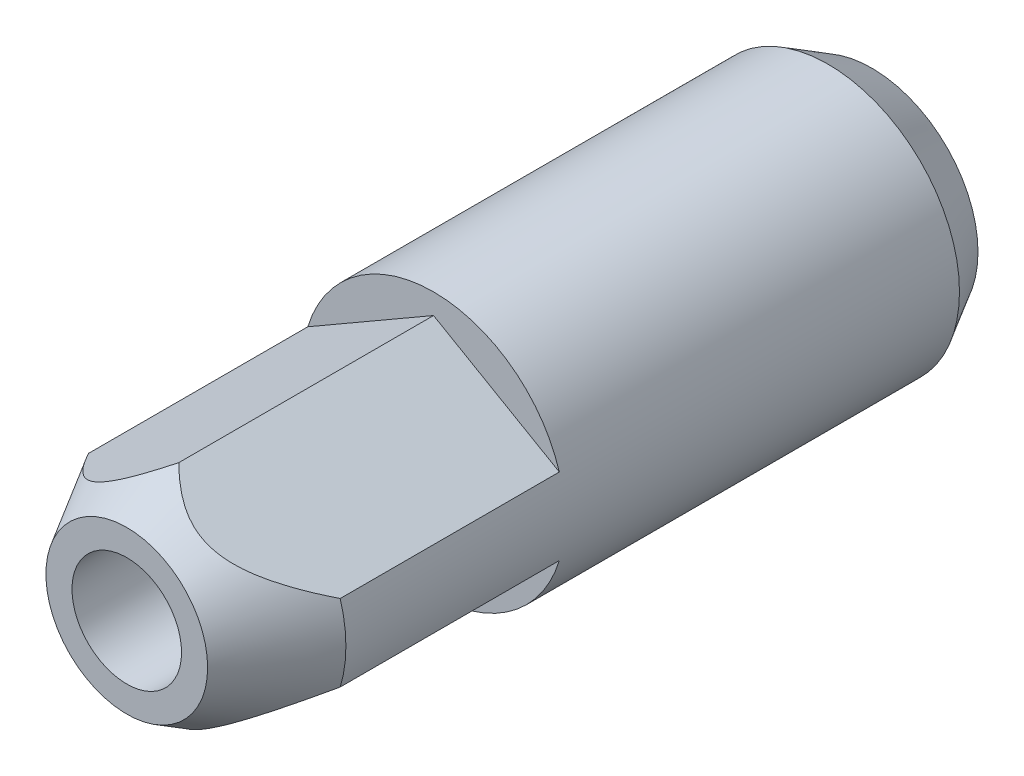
ISO-10303-21;
HEADER;
FILE_DESCRIPTION(('STEP AP214'),'2;1');
FILE_NAME('part.step','',(''),(''),'','','');
FILE_SCHEMA(('AUTOMOTIVE_DESIGN { 1 0 10303 214 1 1 1 1 }'));
ENDSEC;
DATA;
#1=APPLICATION_CONTEXT('core data for automotive mechanical design processes');
#2=APPLICATION_PROTOCOL_DEFINITION('international standard','automotive_design',2000,#1);
#3=PRODUCT_CONTEXT('',#1,'mechanical');
#4=PRODUCT('Part','Part','',(#3));
#5=PRODUCT_RELATED_PRODUCT_CATEGORY('part','',(#4));
#6=PRODUCT_DEFINITION_FORMATION('','',#4);
#7=PRODUCT_DEFINITION_CONTEXT('part definition',#1,'design');
#8=PRODUCT_DEFINITION('design','',#6,#7);
#9=PRODUCT_DEFINITION_SHAPE('','',#8);
#10=(LENGTH_UNIT() NAMED_UNIT(*) SI_UNIT(.MILLI.,.METRE.));
#11=(NAMED_UNIT(*) PLANE_ANGLE_UNIT() SI_UNIT($,.RADIAN.));
#12=(NAMED_UNIT(*) SI_UNIT($,.STERADIAN.) SOLID_ANGLE_UNIT());
#13=UNCERTAINTY_MEASURE_WITH_UNIT(LENGTH_MEASURE(1.E-05),#10,'distance_accuracy_value','');
#14=(GEOMETRIC_REPRESENTATION_CONTEXT(3) GLOBAL_UNCERTAINTY_ASSIGNED_CONTEXT((#13)) GLOBAL_UNIT_ASSIGNED_CONTEXT((#10,
#11,#12)) REPRESENTATION_CONTEXT('',''));
#15=CARTESIAN_POINT('',(0.,0.,0.));
#16=DIRECTION('',(0.,0.,1.));
#17=DIRECTION('',(1.,0.,0.));
#18=AXIS2_PLACEMENT_3D('',#15,#16,#17);
#19=CARTESIAN_POINT('',(0.,0.,30.));
#20=DIRECTION('',(0.,0.,-1.));
#21=DIRECTION('',(-1.,0.,0.));
#22=AXIS2_PLACEMENT_3D('',#19,#20,#21);
#23=CONICAL_SURFACE('',#22,6.,0.523598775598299);
#24=CARTESIAN_POINT('',(0.,0.,34.));
#25=DIRECTION('',(0.,0.,1.));
#26=DIRECTION('',(1.,0.,0.));
#27=AXIS2_PLACEMENT_3D('',#24,#25,#26);
#28=CIRCLE('',#27,3.69059892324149);
#29=CARTESIAN_POINT('',(3.69059892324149,0.,34.));
#30=VERTEX_POINT('',#29);
#31=EDGE_CURVE('E23',#30,#30,#28,.T.);
#32=ORIENTED_EDGE('',*,*,#31,.F.);
#33=EDGE_LOOP('',(#32));
#34=FACE_BOUND('',#33,.T.);
#35=CARTESIAN_POINT('',(-0.000199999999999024,5.06359802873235,31.6218957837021));
#36=CARTESIAN_POINT('',(0.0456557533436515,5.0371231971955,31.6677499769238));
#37=CARTESIAN_POINT('',(0.0919689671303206,5.01038425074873,31.7129927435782));
#38=CARTESIAN_POINT('',(0.185610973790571,4.95632001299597,31.802085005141));
#39=CARTESIAN_POINT('',(0.232940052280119,4.92899455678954,31.8459340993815));
#40=CARTESIAN_POINT('',(0.377050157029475,4.84579254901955,31.9755348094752));
#41=CARTESIAN_POINT('',(0.475488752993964,4.78895899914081,32.0588689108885));
#42=CARTESIAN_POINT('',(0.680067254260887,4.67084554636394,32.2190872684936));
#43=CARTESIAN_POINT('',(0.786341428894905,4.60948812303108,32.295745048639));
#44=CARTESIAN_POINT('',(1.00464804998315,4.48344873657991,32.436841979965));
#45=CARTESIAN_POINT('',(1.11666704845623,4.41877453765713,32.5013081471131));
#46=CARTESIAN_POINT('',(1.29419931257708,4.31627623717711,32.5884036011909));
#47=CARTESIAN_POINT('',(1.35763349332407,4.27965249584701,32.6167078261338));
#48=CARTESIAN_POINT('',(1.48616325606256,4.20544580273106,32.6678302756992));
#49=CARTESIAN_POINT('',(1.55125896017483,4.16786278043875,32.6906480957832));
#50=CARTESIAN_POINT('',(1.68233479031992,4.09218611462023,32.7299254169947));
#51=CARTESIAN_POINT('',(1.74830382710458,4.05409887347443,32.7464338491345));
#52=CARTESIAN_POINT('',(1.8812347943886,3.97735114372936,32.7727502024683));
#53=CARTESIAN_POINT('',(1.94819653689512,3.93869076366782,32.7825593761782));
#54=CARTESIAN_POINT('',(2.08326503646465,3.86070892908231,32.7951455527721));
#55=CARTESIAN_POINT('',(2.15137661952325,3.8213846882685,32.7978544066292));
#56=CARTESIAN_POINT('',(2.28751896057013,3.74278287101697,32.7959266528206));
#57=CARTESIAN_POINT('',(2.35554971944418,3.70350529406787,32.79129012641));
#58=CARTESIAN_POINT('',(2.49105945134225,3.6252687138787,32.7748555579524));
#59=CARTESIAN_POINT('',(2.5585374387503,3.58631027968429,32.7630467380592));
#60=CARTESIAN_POINT('',(2.69237138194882,3.50904121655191,32.7327379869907));
#61=CARTESIAN_POINT('',(2.75872663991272,3.47073099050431,32.7142340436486));
#62=CARTESIAN_POINT('',(2.992983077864,3.33548297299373,32.6373211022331));
#63=CARTESIAN_POINT('',(3.15681232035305,3.24089611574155,32.5618613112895));
#64=CARTESIAN_POINT('',(3.39384465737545,3.10404543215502,32.4276131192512));
#65=CARTESIAN_POINT('',(3.47178448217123,3.05904685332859,32.3790464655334));
#66=CARTESIAN_POINT('',(3.62477355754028,2.97071856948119,32.2761608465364));
#67=CARTESIAN_POINT('',(3.69982356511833,2.92738842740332,32.2218434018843));
#68=CARTESIAN_POINT('',(3.87054592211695,2.82882182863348,32.0906244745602));
#69=CARTESIAN_POINT('',(3.96522544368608,2.7741585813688,32.0120170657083));
#70=CARTESIAN_POINT('',(4.15052824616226,2.66717395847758,31.8486252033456));
#71=CARTESIAN_POINT('',(4.24114964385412,2.61485367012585,31.7638379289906));
#72=CARTESIAN_POINT('',(4.41912601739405,2.51209896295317,31.5892470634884));
#73=CARTESIAN_POINT('',(4.50647069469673,2.46167049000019,31.4994295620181));
#74=CARTESIAN_POINT('',(4.67813923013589,2.362557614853,31.3160201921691));
#75=CARTESIAN_POINT('',(4.76246273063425,2.31387341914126,31.2224278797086));
#76=CARTESIAN_POINT('',(4.92413183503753,2.22053371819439,31.0372571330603));
#77=CARTESIAN_POINT('',(5.00161079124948,2.17580122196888,30.9458332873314));
#78=CARTESIAN_POINT('',(5.15456019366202,2.08749584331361,30.7607646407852));
#79=CARTESIAN_POINT('',(5.23003049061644,2.04392304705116,30.6671196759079));
#80=CARTESIAN_POINT('',(5.37866741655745,1.9581074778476,30.4786978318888));
#81=CARTESIAN_POINT('',(5.4518469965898,1.91585722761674,30.3839345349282));
#82=CARTESIAN_POINT('',(5.59667485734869,1.83224082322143,30.1928988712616));
#83=CARTESIAN_POINT('',(5.66832349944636,1.79087446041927,30.0966268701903));
#84=CARTESIAN_POINT('',(5.7393201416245,1.74988452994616,29.9997269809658));
#85=B_SPLINE_CURVE_WITH_KNOTS('',3,(#35,#36,#37,#38,#39,#40,#41,#42,#43,#44,#45,#46,#47,#48,#49,
#50,#51,#52,#53,#54,#55,#56,#57,#58,#59,#60,#61,#62,#63,#64,#65,#66,#67,#68,#69,#70,#71,#72,#73,
#74,#75,#76,#77,#78,#79,#80,#81,#82,#83,#84),.UNSPECIFIED.,.F.,.F.,(4,2,2,2,2,2,2,2,2,2,2,2,2,2,
2,2,2,2,2,2,2,2,2,2,4),(0.,0.210124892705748,0.420309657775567,0.842819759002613,
1.27641080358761,1.70902947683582,1.94442910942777,2.17984609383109,2.41339840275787,
2.64690703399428,2.88264881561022,3.11838798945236,3.35448228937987,3.59071830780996,
4.19771203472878,4.504405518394,4.81101810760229,5.21469491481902,5.61855715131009,
6.02359738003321,6.42868539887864,6.81238472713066,7.1961124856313,7.57698878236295,
7.95777415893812),.UNSPECIFIED.);
#86=CARTESIAN_POINT('',(0.,5.06348255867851,31.6220957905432));
#87=VERTEX_POINT('',#86);
#88=CARTESIAN_POINT('',(5.7391201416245,1.75,30.));
#89=VERTEX_POINT('',#88);
#90=EDGE_CURVE('E102',#87,#89,#85,.T.);
#91=ORIENTED_EDGE('',*,*,#90,.F.);
#92=CARTESIAN_POINT('',(0.000199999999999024,5.06359802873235,31.6218957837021));
#93=CARTESIAN_POINT('',(-0.0456557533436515,5.0371231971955,31.6677499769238));
#94=CARTESIAN_POINT('',(-0.0919689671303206,5.01038425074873,31.7129927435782));
#95=CARTESIAN_POINT('',(-0.185610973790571,4.95632001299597,31.802085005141));
#96=CARTESIAN_POINT('',(-0.232940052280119,4.92899455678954,31.8459340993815));
#97=CARTESIAN_POINT('',(-0.377050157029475,4.84579254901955,31.9755348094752));
#98=CARTESIAN_POINT('',(-0.475488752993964,4.78895899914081,32.0588689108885));
#99=CARTESIAN_POINT('',(-0.680067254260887,4.67084554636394,32.2190872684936));
#100=CARTESIAN_POINT('',(-0.786341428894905,4.60948812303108,32.295745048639));
#101=CARTESIAN_POINT('',(-1.00464804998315,4.48344873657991,32.436841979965));
#102=CARTESIAN_POINT('',(-1.11666704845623,4.41877453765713,32.5013081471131));
#103=CARTESIAN_POINT('',(-1.29419931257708,4.31627623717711,32.5884036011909));
#104=CARTESIAN_POINT('',(-1.35763349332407,4.27965249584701,32.6167078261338));
#105=CARTESIAN_POINT('',(-1.48616325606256,4.20544580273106,32.6678302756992));
#106=CARTESIAN_POINT('',(-1.55125896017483,4.16786278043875,32.6906480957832));
#107=CARTESIAN_POINT('',(-1.68233479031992,4.09218611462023,32.7299254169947));
#108=CARTESIAN_POINT('',(-1.74830382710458,4.05409887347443,32.7464338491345));
#109=CARTESIAN_POINT('',(-1.8812347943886,3.97735114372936,32.7727502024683));
#110=CARTESIAN_POINT('',(-1.94819653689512,3.93869076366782,32.7825593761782));
#111=CARTESIAN_POINT('',(-2.08326503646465,3.86070892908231,32.7951455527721));
#112=CARTESIAN_POINT('',(-2.15137661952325,3.8213846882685,32.7978544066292));
#113=CARTESIAN_POINT('',(-2.28751896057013,3.74278287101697,32.7959266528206));
#114=CARTESIAN_POINT('',(-2.35554971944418,3.70350529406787,32.79129012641));
#115=CARTESIAN_POINT('',(-2.49105945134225,3.6252687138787,32.7748555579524));
#116=CARTESIAN_POINT('',(-2.5585374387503,3.58631027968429,32.7630467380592));
#117=CARTESIAN_POINT('',(-2.69237138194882,3.50904121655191,32.7327379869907));
#118=CARTESIAN_POINT('',(-2.75872663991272,3.47073099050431,32.7142340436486));
#119=CARTESIAN_POINT('',(-2.992983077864,3.33548297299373,32.6373211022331));
#120=CARTESIAN_POINT('',(-3.15681232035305,3.24089611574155,32.5618613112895));
#121=CARTESIAN_POINT('',(-3.39384465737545,3.10404543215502,32.4276131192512));
#122=CARTESIAN_POINT('',(-3.47178448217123,3.05904685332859,32.3790464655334));
#123=CARTESIAN_POINT('',(-3.62477355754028,2.97071856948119,32.2761608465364));
#124=CARTESIAN_POINT('',(-3.69982356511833,2.92738842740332,32.2218434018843));
#125=CARTESIAN_POINT('',(-3.87054592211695,2.82882182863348,32.0906244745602));
#126=CARTESIAN_POINT('',(-3.96522544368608,2.7741585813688,32.0120170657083));
#127=CARTESIAN_POINT('',(-4.15052824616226,2.66717395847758,31.8486252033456));
#128=CARTESIAN_POINT('',(-4.24114964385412,2.61485367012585,31.7638379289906));
#129=CARTESIAN_POINT('',(-4.41912601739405,2.51209896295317,31.5892470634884));
#130=CARTESIAN_POINT('',(-4.50647069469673,2.46167049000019,31.4994295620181));
#131=CARTESIAN_POINT('',(-4.67813923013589,2.362557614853,31.3160201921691));
#132=CARTESIAN_POINT('',(-4.76246273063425,2.31387341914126,31.2224278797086));
#133=CARTESIAN_POINT('',(-4.92413183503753,2.22053371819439,31.0372571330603));
#134=CARTESIAN_POINT('',(-5.00161079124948,2.17580122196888,30.9458332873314));
#135=CARTESIAN_POINT('',(-5.15456019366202,2.08749584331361,30.7607646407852));
#136=CARTESIAN_POINT('',(-5.23003049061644,2.04392304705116,30.6671196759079));
#137=CARTESIAN_POINT('',(-5.37866741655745,1.9581074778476,30.4786978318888));
#138=CARTESIAN_POINT('',(-5.4518469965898,1.91585722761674,30.3839345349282));
#139=CARTESIAN_POINT('',(-5.59667485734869,1.83224082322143,30.1928988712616));
#140=CARTESIAN_POINT('',(-5.66832349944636,1.79087446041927,30.0966268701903));
#141=CARTESIAN_POINT('',(-5.7393201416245,1.74988452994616,29.9997269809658));
#142=B_SPLINE_CURVE_WITH_KNOTS('',3,(#92,#93,#94,#95,#96,#97,#98,#99,#100,#101,#102,#103,#104,
#105,#106,#107,#108,#109,#110,#111,#112,#113,#114,#115,#116,#117,#118,#119,#120,#121,#122,#123,
#124,#125,#126,#127,#128,#129,#130,#131,#132,#133,#134,#135,#136,#137,#138,#139,#140,#141),
.UNSPECIFIED.,.F.,.F.,(4,2,2,2,2,2,2,2,2,2,2,2,2,2,2,2,2,2,2,2,2,2,2,2,4),(0.,0.210124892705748,
0.420309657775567,0.842819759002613,1.27641080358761,1.70902947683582,1.94442910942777,
2.17984609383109,2.41339840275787,2.64690703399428,2.88264881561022,3.11838798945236,
3.35448228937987,3.59071830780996,4.19771203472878,4.504405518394,4.81101810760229,
5.21469491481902,5.61855715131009,6.02359738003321,6.42868539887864,6.81238472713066,
7.1961124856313,7.57698878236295,7.95777415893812),.UNSPECIFIED.);
#143=CARTESIAN_POINT('',(-5.7391201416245,1.75,30.));
#144=VERTEX_POINT('',#143);
#145=EDGE_CURVE('E75',#87,#144,#142,.T.);
#146=ORIENTED_EDGE('',*,*,#145,.T.);
#147=CARTESIAN_POINT('',(0.,0.,30.));
#148=DIRECTION('',(0.,0.,1.));
#149=DIRECTION('',(1.,0.,0.));
#150=AXIS2_PLACEMENT_3D('',#147,#148,#149);
#151=CIRCLE('',#150,6.);
#152=CARTESIAN_POINT('',(-5.7391201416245,-1.75,30.));
#153=VERTEX_POINT('',#152);
#154=EDGE_CURVE('E155',#144,#153,#151,.T.);
#155=ORIENTED_EDGE('',*,*,#154,.T.);
#156=CARTESIAN_POINT('',(0.000199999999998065,-5.0635980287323,31.6218957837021));
#157=CARTESIAN_POINT('',(-0.0456557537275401,-5.03712319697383,31.6677499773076));
#158=CARTESIAN_POINT('',(-0.0919689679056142,-5.0103842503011,31.7129927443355));
#159=CARTESIAN_POINT('',(-0.18561097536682,-4.95632001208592,31.8020850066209));
#160=CARTESIAN_POINT('',(-0.232940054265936,-4.92899455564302,31.8459341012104));
#161=CARTESIAN_POINT('',(-0.377050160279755,-4.84579254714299,31.9755348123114));
#162=CARTESIAN_POINT('',(-0.475488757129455,-4.78895899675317,32.0588689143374));
#163=CARTESIAN_POINT('',(-0.680067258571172,-4.67084554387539,32.2190872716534));
#164=CARTESIAN_POINT('',(-0.786341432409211,-4.6094881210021,32.2957450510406));
#165=CARTESIAN_POINT('',(-1.00464805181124,-4.48344873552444,32.436841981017));
#166=CARTESIAN_POINT('',(-1.11666704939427,-4.4187745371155,32.5013081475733));
#167=CARTESIAN_POINT('',(-1.29419931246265,-4.31627623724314,32.5884036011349));
#168=CARTESIAN_POINT('',(-1.35763349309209,-4.27965249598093,32.6167078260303));
#169=CARTESIAN_POINT('',(-1.48616325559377,-4.20544580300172,32.667830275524));
#170=CARTESIAN_POINT('',(-1.55125895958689,-4.16786278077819,32.6906480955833));
#171=CARTESIAN_POINT('',(-1.68233478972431,-4.0921861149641,32.7299254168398));
#172=CARTESIAN_POINT('',(-1.74830382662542,-4.05409887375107,32.7464338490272));
#173=CARTESIAN_POINT('',(-1.88123479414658,-3.97735114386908,32.7727502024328));
#174=CARTESIAN_POINT('',(-1.94819653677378,-3.93869076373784,32.7825593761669));
#175=CARTESIAN_POINT('',(-2.08326503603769,-3.86070892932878,32.7951455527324));
#176=CARTESIAN_POINT('',(-2.15137661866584,-3.82138468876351,32.7978544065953));
#177=CARTESIAN_POINT('',(-2.28751895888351,-3.74278287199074,32.7959266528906));
#178=CARTESIAN_POINT('',(-2.35554971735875,-3.70350529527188,32.7912901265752));
#179=CARTESIAN_POINT('',(-2.49105944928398,-3.62526871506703,32.7748555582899));
#180=CARTESIAN_POINT('',(-2.5585374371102,-3.5863102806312,32.7630467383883));
#181=CARTESIAN_POINT('',(-2.69237138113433,-3.50904121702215,32.7327379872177));
#182=CARTESIAN_POINT('',(-2.75872663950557,-3.47073099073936,32.7142340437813));
#183=CARTESIAN_POINT('',(-2.99298308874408,-3.33548296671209,32.6373210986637));
#184=CARTESIAN_POINT('',(-3.15681234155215,-3.24089610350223,32.561861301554));
#185=CARTESIAN_POINT('',(-3.39384468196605,-3.10404541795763,32.4276131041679));
#186=CARTESIAN_POINT('',(-3.47178450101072,-3.0590468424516,32.3790464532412));
#187=CARTESIAN_POINT('',(-3.62477356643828,-2.97071856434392,32.2761608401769));
#188=CARTESIAN_POINT('',(-3.69982356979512,-2.92738842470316,32.2218433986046));
#189=CARTESIAN_POINT('',(-3.87054287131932,-2.82882359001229,32.0906268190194));
#190=CARTESIAN_POINT('',(-3.96521948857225,-2.77416201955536,32.0120220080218));
#191=CARTESIAN_POINT('',(-4.15051671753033,-2.66718061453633,31.8486356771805));
#192=CARTESIAN_POINT('',(-4.24113544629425,-2.61486186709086,31.7638513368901));
#193=CARTESIAN_POINT('',(-4.41910664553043,-2.51211014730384,31.5892665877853));
#194=CARTESIAN_POINT('',(-4.50644881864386,-2.4616831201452,31.4994522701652));
#195=CARTESIAN_POINT('',(-4.67811249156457,-2.36257305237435,31.3160494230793));
#196=CARTESIAN_POINT('',(-4.76243363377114,-2.31389021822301,31.2224604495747));
#197=CARTESIAN_POINT('',(-4.92409843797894,-2.22055299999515,31.0372961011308));
#198=CARTESIAN_POINT('',(-5.00157544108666,-2.1758216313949,30.9458753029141));
#199=CARTESIAN_POINT('',(-5.15452100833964,-2.08751846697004,30.7608128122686));
#200=CARTESIAN_POINT('',(-5.22998942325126,-2.0439467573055,30.6671709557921));
#201=CARTESIAN_POINT('',(-5.37862268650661,-1.95813330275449,30.4787553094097));
#202=CARTESIAN_POINT('',(-5.45180048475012,-1.9158840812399,30.383995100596));
#203=CARTESIAN_POINT('',(-5.59662482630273,-1.83226970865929,30.1929656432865));
#204=CARTESIAN_POINT('',(-5.66827173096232,-1.79090434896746,30.0966967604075));
#205=CARTESIAN_POINT('',(-5.73926665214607,-1.74991541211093,29.9998));
#206=B_SPLINE_CURVE_WITH_KNOTS('',3,(#156,#157,#158,#159,#160,#161,#162,#163,#164,#165,#166,
#167,#168,#169,#170,#171,#172,#173,#174,#175,#176,#177,#178,#179,#180,#181,#182,#183,#184,#185,
#186,#187,#188,#189,#190,#191,#192,#193,#194,#195,#196,#197,#198,#199,#200,#201,#202,#203,#204,
#205),.UNSPECIFIED.,.F.,.F.,(4,2,2,2,2,2,2,2,2,2,2,2,2,2,2,2,2,2,2,2,2,2,2,2,4),(0.,
0.210124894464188,0.420309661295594,0.84281976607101,1.27641080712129,1.7090294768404,
1.94442910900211,2.17984609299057,2.41339840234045,2.6469070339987,2.88264881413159,
3.11838798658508,3.35448228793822,3.59071830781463,4.19771207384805,4.50440553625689,
4.81101810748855,5.21468222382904,5.61853174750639,6.02355915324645,6.42863434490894,
6.81232240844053,7.19603890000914,7.57690417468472,7.9576785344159),.UNSPECIFIED.);
#207=CARTESIAN_POINT('',(0.,-5.06348255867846,31.6220957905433));
#208=VERTEX_POINT('',#207);
#209=EDGE_CURVE('E129',#208,#153,#206,.T.);
#210=ORIENTED_EDGE('',*,*,#209,.F.);
#211=CARTESIAN_POINT('',(-0.000200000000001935,-5.0635980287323,31.6218957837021));
#212=CARTESIAN_POINT('',(0.0456557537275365,-5.03712319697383,31.6677499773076));
#213=CARTESIAN_POINT('',(0.0919689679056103,-5.0103842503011,31.7129927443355));
#214=CARTESIAN_POINT('',(0.185610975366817,-4.95632001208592,31.8020850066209));
#215=CARTESIAN_POINT('',(0.232940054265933,-4.92899455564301,31.8459341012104));
#216=CARTESIAN_POINT('',(0.377050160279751,-4.84579254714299,31.9755348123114));
#217=CARTESIAN_POINT('',(0.475488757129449,-4.78895899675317,32.0588689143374));
#218=CARTESIAN_POINT('',(0.680067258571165,-4.67084554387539,32.2190872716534));
#219=CARTESIAN_POINT('',(0.786341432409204,-4.6094881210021,32.2957450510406));
#220=CARTESIAN_POINT('',(1.00464805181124,-4.48344873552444,32.436841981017));
#221=CARTESIAN_POINT('',(1.11666704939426,-4.4187745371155,32.5013081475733));
#222=CARTESIAN_POINT('',(1.29419931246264,-4.31627623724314,32.5884036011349));
#223=CARTESIAN_POINT('',(1.35763349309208,-4.27965249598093,32.6167078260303));
#224=CARTESIAN_POINT('',(1.48616325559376,-4.20544580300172,32.667830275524));
#225=CARTESIAN_POINT('',(1.55125895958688,-4.16786278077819,32.6906480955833));
#226=CARTESIAN_POINT('',(1.6823347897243,-4.0921861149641,32.7299254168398));
#227=CARTESIAN_POINT('',(1.74830382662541,-4.05409887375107,32.7464338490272));
#228=CARTESIAN_POINT('',(1.88123479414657,-3.97735114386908,32.7727502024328));
#229=CARTESIAN_POINT('',(1.94819653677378,-3.93869076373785,32.7825593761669));
#230=CARTESIAN_POINT('',(2.08326503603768,-3.86070892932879,32.7951455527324));
#231=CARTESIAN_POINT('',(2.15137661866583,-3.82138468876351,32.7978544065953));
#232=CARTESIAN_POINT('',(2.28751895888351,-3.74278287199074,32.7959266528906));
#233=CARTESIAN_POINT('',(2.35554971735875,-3.70350529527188,32.7912901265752));
#234=CARTESIAN_POINT('',(2.49105944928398,-3.62526871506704,32.7748555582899));
#235=CARTESIAN_POINT('',(2.55853743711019,-3.5863102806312,32.7630467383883));
#236=CARTESIAN_POINT('',(2.69237138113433,-3.50904121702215,32.7327379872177));
#237=CARTESIAN_POINT('',(2.75872663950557,-3.47073099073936,32.7142340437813));
#238=CARTESIAN_POINT('',(2.99298308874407,-3.33548296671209,32.6373210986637));
#239=CARTESIAN_POINT('',(3.15681234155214,-3.24089610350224,32.5618613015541));
#240=CARTESIAN_POINT('',(3.39384468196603,-3.10404541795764,32.4276131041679));
#241=CARTESIAN_POINT('',(3.47178450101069,-3.05904684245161,32.3790464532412));
#242=CARTESIAN_POINT('',(3.62477356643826,-2.97071856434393,32.276160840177));
#243=CARTESIAN_POINT('',(3.69982356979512,-2.92738842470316,32.2218433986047));
#244=CARTESIAN_POINT('',(3.87054287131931,-2.8288235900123,32.0906268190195));
#245=CARTESIAN_POINT('',(3.96521948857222,-2.77416201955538,32.0120220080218));
#246=CARTESIAN_POINT('',(4.1505167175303,-2.66718061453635,31.8486356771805));
#247=CARTESIAN_POINT('',(4.24113544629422,-2.61486186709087,31.7638513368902));
#248=CARTESIAN_POINT('',(4.41910664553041,-2.51211014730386,31.5892665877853));
#249=CARTESIAN_POINT('',(4.50644881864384,-2.46168312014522,31.4994522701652));
#250=CARTESIAN_POINT('',(4.67811249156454,-2.36257305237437,31.3160494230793));
#251=CARTESIAN_POINT('',(4.76243363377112,-2.31389021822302,31.2224604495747));
#252=CARTESIAN_POINT('',(4.92409843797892,-2.22055299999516,31.0372961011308));
#253=CARTESIAN_POINT('',(5.00157544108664,-2.17582163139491,30.9458753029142));
#254=CARTESIAN_POINT('',(5.15452100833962,-2.08751846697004,30.7608128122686));
#255=CARTESIAN_POINT('',(5.22998942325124,-2.04394675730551,30.6671709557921));
#256=CARTESIAN_POINT('',(5.3786226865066,-1.95813330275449,30.4787553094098));
#257=CARTESIAN_POINT('',(5.45180048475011,-1.9158840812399,30.383995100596));
#258=CARTESIAN_POINT('',(5.59662482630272,-1.83226970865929,30.1929656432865));
#259=CARTESIAN_POINT('',(5.66827173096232,-1.79090434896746,30.0966967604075));
#260=CARTESIAN_POINT('',(5.73926665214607,-1.74991541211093,29.9998));
#261=B_SPLINE_CURVE_WITH_KNOTS('',3,(#211,#212,#213,#214,#215,#216,#217,#218,#219,#220,#221,
#222,#223,#224,#225,#226,#227,#228,#229,#230,#231,#232,#233,#234,#235,#236,#237,#238,#239,#240,
#241,#242,#243,#244,#245,#246,#247,#248,#249,#250,#251,#252,#253,#254,#255,#256,#257,#258,#259,
#260),.UNSPECIFIED.,.F.,.F.,(4,2,2,2,2,2,2,2,2,2,2,2,2,2,2,2,2,2,2,2,2,2,2,2,4),(0.,
0.210124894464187,0.420309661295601,0.842819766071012,1.27641080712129,1.7090294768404,
1.9444291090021,2.17984609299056,2.41339840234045,2.64690703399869,2.88264881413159,
3.11838798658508,3.35448228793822,3.59071830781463,4.19771207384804,4.50440553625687,
4.81101810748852,5.214682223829,5.61853174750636,6.02355915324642,6.42863434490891,
6.81232240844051,7.19603890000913,7.57690417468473,7.95767853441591),.UNSPECIFIED.);
#262=CARTESIAN_POINT('',(5.7391201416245,-1.75,30.));
#263=VERTEX_POINT('',#262);
#264=EDGE_CURVE('E138',#208,#263,#261,.T.);
#265=ORIENTED_EDGE('',*,*,#264,.T.);
#266=EDGE_CURVE('E156',#263,#89,#151,.T.);
#267=ORIENTED_EDGE('',*,*,#266,.T.);
#268=EDGE_LOOP('',(#91,#146,#155,#210,#265,#267));
#269=FACE_BOUND('',#268,.T.);
#270=ADVANCED_FACE('F15',(#34,#269),#23,.T.);
#271=CARTESIAN_POINT('',(0.,0.,30.));
#272=DIRECTION('',(0.,0.,1.));
#273=DIRECTION('',(1.,0.,0.));
#274=AXIS2_PLACEMENT_3D('',#271,#272,#273);
#275=CYLINDRICAL_SURFACE('',#274,6.);
#276=CARTESIAN_POINT('',(0.,0.,2.));
#277=DIRECTION('',(0.,0.,1.));
#278=DIRECTION('',(1.,0.,0.));
#279=AXIS2_PLACEMENT_3D('',#276,#277,#278);
#280=CIRCLE('',#279,6.);
#281=CARTESIAN_POINT('',(6.,0.,2.));
#282=VERTEX_POINT('',#281);
#283=EDGE_CURVE('E152',#282,#282,#280,.T.);
#284=ORIENTED_EDGE('',*,*,#283,.T.);
#285=EDGE_LOOP('',(#284));
#286=FACE_BOUND('',#285,.T.);
#287=DIRECTION('',(0.,0.,1.));
#288=VECTOR('',#287,1.);
#289=CARTESIAN_POINT('',(5.7391201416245,1.75,20.));
#290=LINE('',#289,#288);
#291=CARTESIAN_POINT('',(5.7391201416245,1.75,20.));
#292=VERTEX_POINT('',#291);
#293=EDGE_CURVE('E82',#292,#89,#290,.T.);
#294=ORIENTED_EDGE('',*,*,#293,.T.);
#295=ORIENTED_EDGE('',*,*,#266,.F.);
#296=DIRECTION('',(0.,0.,1.));
#297=VECTOR('',#296,1.);
#298=CARTESIAN_POINT('',(5.7391201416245,-1.75,20.));
#299=LINE('',#298,#297);
#300=CARTESIAN_POINT('',(5.7391201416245,-1.75,20.));
#301=VERTEX_POINT('',#300);
#302=EDGE_CURVE('E179',#301,#263,#299,.T.);
#303=ORIENTED_EDGE('',*,*,#302,.F.);
#304=CARTESIAN_POINT('',(0.,0.,20.));
#305=DIRECTION('',(0.,0.,1.));
#306=DIRECTION('',(1.,0.,0.));
#307=AXIS2_PLACEMENT_3D('',#304,#305,#306);
#308=CIRCLE('',#307,6.);
#309=CARTESIAN_POINT('',(-5.7391201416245,-1.75,20.));
#310=VERTEX_POINT('',#309);
#311=EDGE_CURVE('E169',#310,#301,#308,.T.);
#312=ORIENTED_EDGE('',*,*,#311,.F.);
#313=DIRECTION('',(0.,0.,1.));
#314=VECTOR('',#313,1.);
#315=CARTESIAN_POINT('',(-5.7391201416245,-1.75,20.));
#316=LINE('',#315,#314);
#317=EDGE_CURVE('E176',#310,#153,#316,.T.);
#318=ORIENTED_EDGE('',*,*,#317,.T.);
#319=ORIENTED_EDGE('',*,*,#154,.F.);
#320=DIRECTION('',(0.,0.,1.));
#321=VECTOR('',#320,1.);
#322=CARTESIAN_POINT('',(-5.7391201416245,1.75,20.));
#323=LINE('',#322,#321);
#324=CARTESIAN_POINT('',(-5.7391201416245,1.75,20.));
#325=VERTEX_POINT('',#324);
#326=EDGE_CURVE('E78',#325,#144,#323,.T.);
#327=ORIENTED_EDGE('',*,*,#326,.F.);
#328=CARTESIAN_POINT('',(0.,0.,20.));
#329=DIRECTION('',(0.,0.,1.));
#330=DIRECTION('',(1.,0.,0.));
#331=AXIS2_PLACEMENT_3D('',#328,#329,#330);
#332=CIRCLE('',#331,6.);
#333=EDGE_CURVE('E86',#292,#325,#332,.T.);
#334=ORIENTED_EDGE('',*,*,#333,.F.);
#335=EDGE_LOOP('',(#294,#295,#303,#312,#318,#319,#327,#334));
#336=FACE_BOUND('',#335,.T.);
#337=ADVANCED_FACE('F165',(#286,#336),#275,.T.);
#338=CARTESIAN_POINT('',(0.,0.,30.));
#339=DIRECTION('',(0.,0.,1.));
#340=DIRECTION('',(1.,0.,0.));
#341=AXIS2_PLACEMENT_3D('',#338,#339,#340);
#342=CYLINDRICAL_SURFACE('',#341,2.5);
#343=CARTESIAN_POINT('',(0.,0.,24.));
#344=DIRECTION('',(0.,0.,1.));
#345=DIRECTION('',(1.,0.,0.));
#346=AXIS2_PLACEMENT_3D('',#343,#344,#345);
#347=CIRCLE('',#346,2.5);
#348=CARTESIAN_POINT('',(2.5,0.,24.));
#349=VERTEX_POINT('',#348);
#350=EDGE_CURVE('E89',#349,#349,#347,.T.);
#351=ORIENTED_EDGE('',*,*,#350,.F.);
#352=EDGE_LOOP('',(#351));
#353=FACE_BOUND('',#352,.T.);
#354=CARTESIAN_POINT('',(0.,0.,34.));
#355=DIRECTION('',(0.,0.,1.));
#356=DIRECTION('',(1.,0.,0.));
#357=AXIS2_PLACEMENT_3D('',#354,#355,#356);
#358=CIRCLE('',#357,2.5);
#359=CARTESIAN_POINT('',(2.5,0.,34.));
#360=VERTEX_POINT('',#359);
#361=EDGE_CURVE('E9',#360,#360,#358,.T.);
#362=ORIENTED_EDGE('',*,*,#361,.T.);
#363=EDGE_LOOP('',(#362));
#364=FACE_BOUND('',#363,.T.);
#365=ADVANCED_FACE('F17',(#353,#364),#342,.F.);
#366=CARTESIAN_POINT('',(3.69059892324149,0.,34.));
#367=DIRECTION('',(0.,0.,-1.));
#368=DIRECTION('',(-1.,0.,0.));
#369=AXIS2_PLACEMENT_3D('',#366,#367,#368);
#370=PLANE('',#369);
#371=ORIENTED_EDGE('',*,*,#361,.F.);
#372=EDGE_LOOP('',(#371));
#373=FACE_BOUND('',#372,.T.);
#374=ORIENTED_EDGE('',*,*,#31,.T.);
#375=EDGE_LOOP('',(#374));
#376=FACE_BOUND('',#375,.T.);
#377=ADVANCED_FACE('F161',(#373,#376),#370,.F.);
#378=CARTESIAN_POINT('',(0.,0.,0.));
#379=DIRECTION('',(0.,0.,1.));
#380=DIRECTION('',(1.,0.,0.));
#381=AXIS2_PLACEMENT_3D('',#378,#379,#380);
#382=CONICAL_SURFACE('',#381,4.84529946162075,0.523598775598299);
#383=ORIENTED_EDGE('',*,*,#283,.F.);
#384=EDGE_LOOP('',(#383));
#385=FACE_BOUND('',#384,.T.);
#386=CARTESIAN_POINT('',(0.,0.,0.));
#387=DIRECTION('',(0.,0.,1.));
#388=DIRECTION('',(1.,0.,0.));
#389=AXIS2_PLACEMENT_3D('',#386,#387,#388);
#390=CIRCLE('',#389,4.84529946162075);
#391=CARTESIAN_POINT('',(4.84529946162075,0.,0.));
#392=VERTEX_POINT('',#391);
#393=EDGE_CURVE('E149',#392,#392,#390,.T.);
#394=ORIENTED_EDGE('',*,*,#393,.T.);
#395=EDGE_LOOP('',(#394));
#396=FACE_BOUND('',#395,.T.);
#397=ADVANCED_FACE('F252',(#385,#396),#382,.T.);
#398=CARTESIAN_POINT('',(1.,0.,0.));
#399=DIRECTION('',(0.,0.,1.));
#400=DIRECTION('',(1.,0.,0.));
#401=AXIS2_PLACEMENT_3D('',#398,#399,#400);
#402=PLANE('',#401);
#403=ORIENTED_EDGE('',*,*,#393,.F.);
#404=EDGE_LOOP('',(#403));
#405=FACE_BOUND('',#404,.T.);
#406=CARTESIAN_POINT('',(0.,0.,0.));
#407=DIRECTION('',(0.,0.,1.));
#408=DIRECTION('',(1.,0.,0.));
#409=AXIS2_PLACEMENT_3D('',#406,#407,#408);
#410=CIRCLE('',#409,1.);
#411=CARTESIAN_POINT('',(1.,0.,0.));
#412=VERTEX_POINT('',#411);
#413=EDGE_CURVE('E146',#412,#412,#410,.T.);
#414=ORIENTED_EDGE('',*,*,#413,.T.);
#415=EDGE_LOOP('',(#414));
#416=FACE_BOUND('',#415,.T.);
#417=ADVANCED_FACE('F257',(#405,#416),#402,.F.);
#418=CARTESIAN_POINT('',(0.,0.,30.));
#419=DIRECTION('',(0.,0.,1.));
#420=DIRECTION('',(1.,0.,0.));
#421=AXIS2_PLACEMENT_3D('',#418,#419,#420);
#422=CYLINDRICAL_SURFACE('',#421,1.);
#423=ORIENTED_EDGE('',*,*,#413,.F.);
#424=EDGE_LOOP('',(#423));
#425=FACE_BOUND('',#424,.T.);
#426=CARTESIAN_POINT('',(0.,0.,4.));
#427=DIRECTION('',(0.,0.,1.));
#428=DIRECTION('',(1.,0.,0.));
#429=AXIS2_PLACEMENT_3D('',#426,#427,#428);
#430=CIRCLE('',#429,1.);
#431=CARTESIAN_POINT('',(1.,0.,4.));
#432=VERTEX_POINT('',#431);
#433=EDGE_CURVE('E137',#432,#432,#430,.T.);
#434=ORIENTED_EDGE('',*,*,#433,.T.);
#435=EDGE_LOOP('',(#434));
#436=FACE_BOUND('',#435,.T.);
#437=ADVANCED_FACE('F266',(#425,#436),#422,.F.);
#438=CARTESIAN_POINT('',(0.,0.,4.));
#439=DIRECTION('',(0.,0.,1.));
#440=DIRECTION('',(1.,0.,0.));
#441=AXIS2_PLACEMENT_3D('',#438,#439,#440);
#442=PLANE('',#441);
#443=ORIENTED_EDGE('',*,*,#433,.F.);
#444=EDGE_LOOP('',(#443));
#445=FACE_BOUND('',#444,.T.);
#446=ADVANCED_FACE('F124',(#445),#442,.F.);
#447=CARTESIAN_POINT('',(-5.7391201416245,-1.75,20.));
#448=DIRECTION('',(-0.5,-0.866025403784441,0.));
#449=DIRECTION('',(0.866025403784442,-0.5,0.));
#450=AXIS2_PLACEMENT_3D('',#447,#448,#449);
#451=PLANE('',#450);
#452=ORIENTED_EDGE('',*,*,#209,.T.);
#453=ORIENTED_EDGE('',*,*,#317,.F.);
#454=DIRECTION('',(0.866025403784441,-0.5,0.));
#455=VECTOR('',#454,1.);
#456=CARTESIAN_POINT('',(-5.7391201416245,-1.75,20.));
#457=LINE('',#456,#455);
#458=CARTESIAN_POINT('',(0.,-5.06348255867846,20.));
#459=VERTEX_POINT('',#458);
#460=EDGE_CURVE('E38',#310,#459,#457,.T.);
#461=ORIENTED_EDGE('',*,*,#460,.T.);
#462=DIRECTION('',(0.,0.,1.));
#463=VECTOR('',#462,1.);
#464=CARTESIAN_POINT('',(0.,-5.06348255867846,20.));
#465=LINE('',#464,#463);
#466=EDGE_CURVE('E180',#459,#208,#465,.T.);
#467=ORIENTED_EDGE('',*,*,#466,.T.);
#468=EDGE_LOOP('',(#452,#453,#461,#467));
#469=FACE_BOUND('',#468,.T.);
#470=ADVANCED_FACE('F120',(#469),#451,.T.);
#471=CARTESIAN_POINT('',(5.7391201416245,-1.75,20.));
#472=DIRECTION('',(-0.5,0.866025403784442,0.));
#473=DIRECTION('',(-0.866025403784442,-0.5,0.));
#474=AXIS2_PLACEMENT_3D('',#471,#472,#473);
#475=PLANE('',#474);
#476=ORIENTED_EDGE('',*,*,#466,.F.);
#477=DIRECTION('',(-0.866025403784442,-0.5,0.));
#478=VECTOR('',#477,1.);
#479=CARTESIAN_POINT('',(5.7391201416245,-1.75,20.));
#480=LINE('',#479,#478);
#481=EDGE_CURVE('E170',#301,#459,#480,.T.);
#482=ORIENTED_EDGE('',*,*,#481,.F.);
#483=ORIENTED_EDGE('',*,*,#302,.T.);
#484=ORIENTED_EDGE('',*,*,#264,.F.);
#485=EDGE_LOOP('',(#476,#482,#483,#484));
#486=FACE_BOUND('',#485,.T.);
#487=ADVANCED_FACE('F119',(#486),#475,.F.);
#488=CARTESIAN_POINT('',(0.,0.,20.));
#489=DIRECTION('',(0.,0.,1.));
#490=DIRECTION('',(1.,0.,0.));
#491=AXIS2_PLACEMENT_3D('',#488,#489,#490);
#492=PLANE('',#491);
#493=ORIENTED_EDGE('',*,*,#460,.F.);
#494=ORIENTED_EDGE('',*,*,#311,.T.);
#495=ORIENTED_EDGE('',*,*,#481,.T.);
#496=EDGE_LOOP('',(#493,#494,#495));
#497=FACE_BOUND('',#496,.T.);
#498=ADVANCED_FACE('F116',(#497),#492,.T.);
#499=CARTESIAN_POINT('',(5.7391201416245,1.75,20.));
#500=DIRECTION('',(0.5,0.866025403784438,0.));
#501=DIRECTION('',(-0.866025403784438,0.5,0.));
#502=AXIS2_PLACEMENT_3D('',#499,#500,#501);
#503=PLANE('',#502);
#504=ORIENTED_EDGE('',*,*,#90,.T.);
#505=ORIENTED_EDGE('',*,*,#293,.F.);
#506=DIRECTION('',(-0.866025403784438,0.5,0.));
#507=VECTOR('',#506,1.);
#508=CARTESIAN_POINT('',(5.7391201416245,1.75,20.));
#509=LINE('',#508,#507);
#510=CARTESIAN_POINT('',(0.,5.06348255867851,20.));
#511=VERTEX_POINT('',#510);
#512=EDGE_CURVE('E30',#292,#511,#509,.T.);
#513=ORIENTED_EDGE('',*,*,#512,.T.);
#514=DIRECTION('',(0.,0.,1.));
#515=VECTOR('',#514,1.);
#516=CARTESIAN_POINT('',(0.,5.06348255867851,20.));
#517=LINE('',#516,#515);
#518=EDGE_CURVE('E71',#511,#87,#517,.T.);
#519=ORIENTED_EDGE('',*,*,#518,.T.);
#520=EDGE_LOOP('',(#504,#505,#513,#519));
#521=FACE_BOUND('',#520,.T.);
#522=ADVANCED_FACE('F80',(#521),#503,.T.);
#523=CARTESIAN_POINT('',(-5.7391201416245,1.75,20.));
#524=DIRECTION('',(0.5,-0.866025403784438,0.));
#525=DIRECTION('',(0.866025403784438,0.5,0.));
#526=AXIS2_PLACEMENT_3D('',#523,#524,#525);
#527=PLANE('',#526);
#528=ORIENTED_EDGE('',*,*,#518,.F.);
#529=DIRECTION('',(0.866025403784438,0.5,0.));
#530=VECTOR('',#529,1.);
#531=CARTESIAN_POINT('',(-5.7391201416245,1.75,20.));
#532=LINE('',#531,#530);
#533=EDGE_CURVE('E73',#325,#511,#532,.T.);
#534=ORIENTED_EDGE('',*,*,#533,.F.);
#535=ORIENTED_EDGE('',*,*,#326,.T.);
#536=ORIENTED_EDGE('',*,*,#145,.F.);
#537=EDGE_LOOP('',(#528,#534,#535,#536));
#538=FACE_BOUND('',#537,.T.);
#539=ADVANCED_FACE('F72',(#538),#527,.F.);
#540=CARTESIAN_POINT('',(0.,0.,20.));
#541=DIRECTION('',(0.,0.,1.));
#542=DIRECTION('',(1.,0.,0.));
#543=AXIS2_PLACEMENT_3D('',#540,#541,#542);
#544=PLANE('',#543);
#545=ORIENTED_EDGE('',*,*,#512,.F.);
#546=ORIENTED_EDGE('',*,*,#333,.T.);
#547=ORIENTED_EDGE('',*,*,#533,.T.);
#548=EDGE_LOOP('',(#545,#546,#547));
#549=FACE_BOUND('',#548,.T.);
#550=ADVANCED_FACE('F85',(#549),#544,.T.);
#551=CARTESIAN_POINT('',(0.,0.,24.));
#552=DIRECTION('',(0.,0.,1.));
#553=DIRECTION('',(1.,0.,0.));
#554=AXIS2_PLACEMENT_3D('',#551,#552,#553);
#555=PLANE('',#554);
#556=ORIENTED_EDGE('',*,*,#350,.T.);
#557=EDGE_LOOP('',(#556));
#558=FACE_BOUND('',#557,.T.);
#559=ADVANCED_FACE('F217',(#558),#555,.T.);
#560=CLOSED_SHELL('',(#270,#337,#365,#377,#397,#417,#437,#446,#470,#487,#498,#522,#539,#550,#559));
#561=MANIFOLD_SOLID_BREP('B1',#560);
#562=ADVANCED_BREP_SHAPE_REPRESENTATION('',(#18,#561),#14);
#563=SHAPE_DEFINITION_REPRESENTATION(#9,#562);
ENDSEC;
END-ISO-10303-21;
